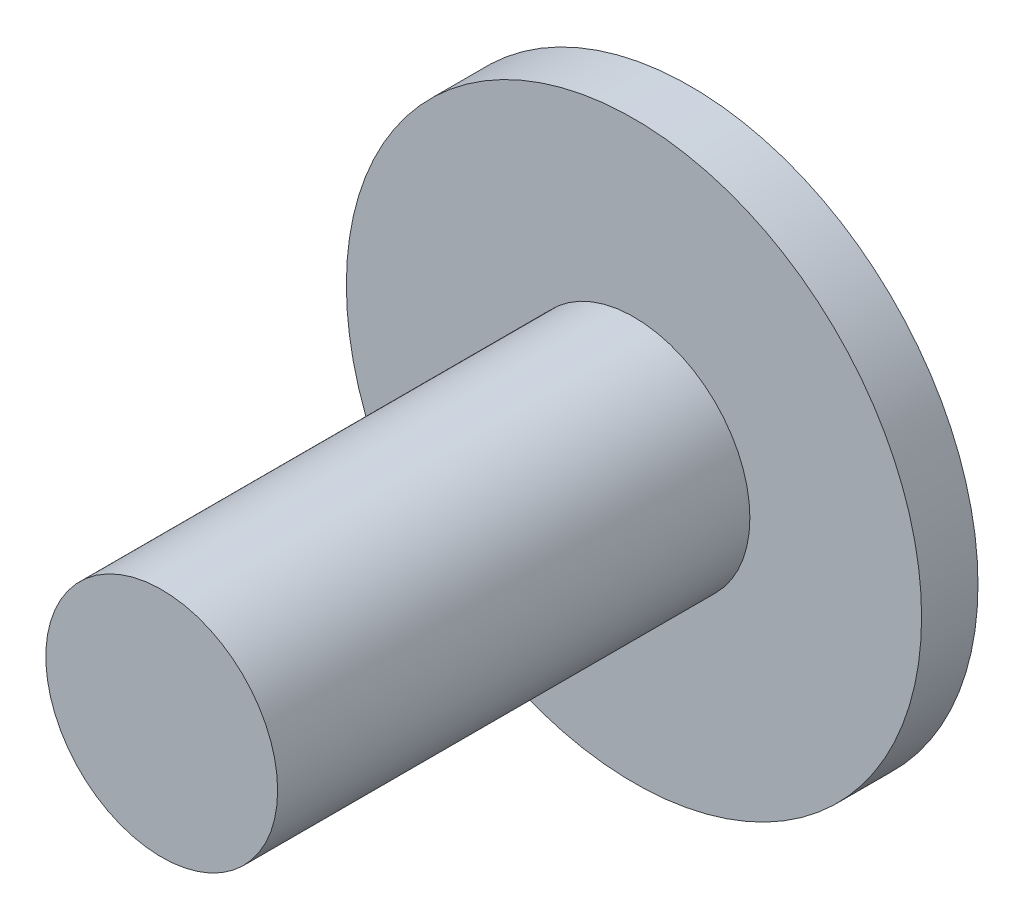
from build123d import *

# Parameters (mm, degrees)
SKETCH1_R           = 24.6126
BOSS_EXTRUDE1_DEPTH = 4.826
SKETCH2_R           = 9.9187
BOSS_EXTRUDE2_DEPTH = 45.2374
SKETCH3_R           = 8.7122
CUT_EXTRUDE1_DEPTH  = 9.525


with BuildPart() as part:
    # Sketch1 → Boss-Extrude1 (new body)
    with BuildSketch(Plane.XY):
        Circle(SKETCH1_R)
    extrude(amount=BOSS_EXTRUDE1_DEPTH)

    # Sketch2 → Boss-Extrude2 (add)
    with BuildSketch(Plane.XY):
        Circle(SKETCH2_R)
    extrude(amount=BOSS_EXTRUDE2_DEPTH)

    # Sketch3 → Cut-Extrude1 (cut)
    with BuildSketch(Plane.XY):
        Circle(SKETCH3_R)
    extrude(amount=CUT_EXTRUDE1_DEPTH, mode=Mode.SUBTRACT)


solid = part.part
